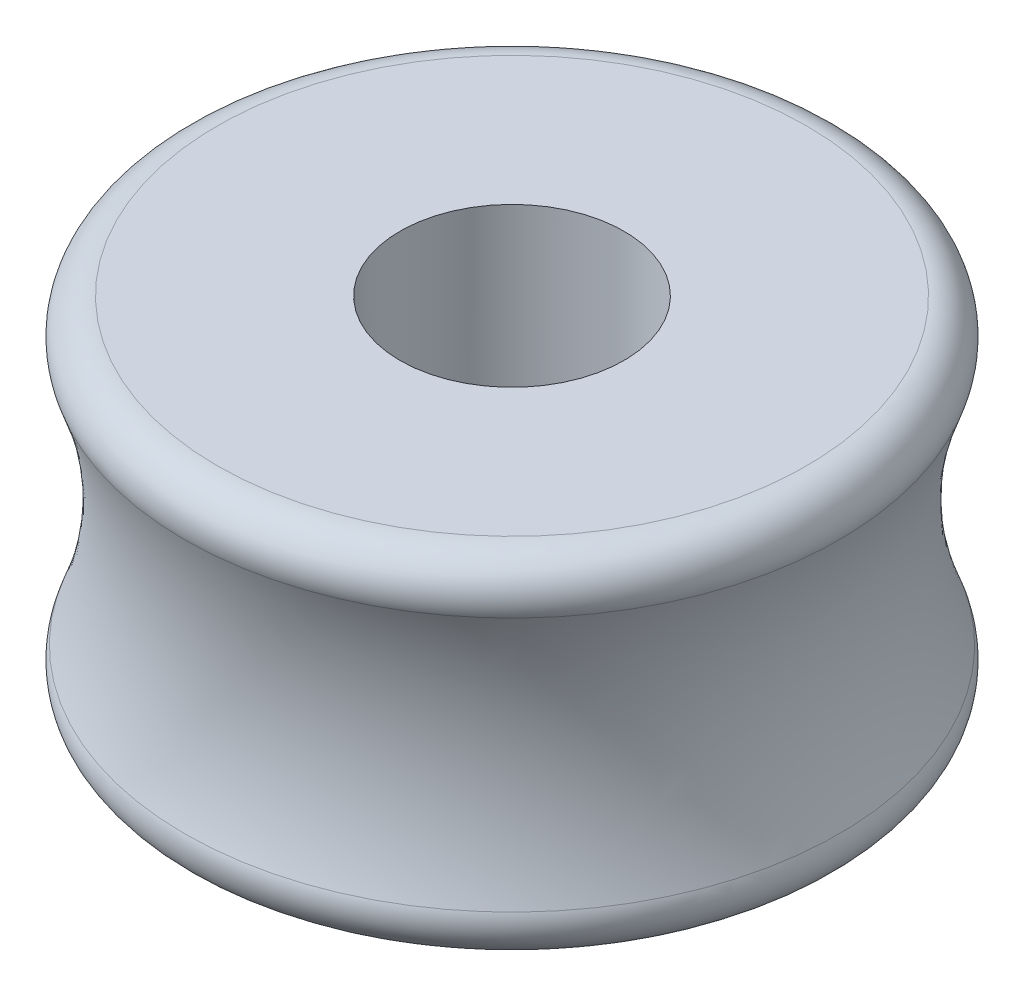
from build123d import *

# Parameters (mm, degrees)
CHAMFER1_SIZE = 0.16


with BuildPart() as part:
    # Sketch1 → Revolve1 (revolve)
    with BuildSketch(Plane.XY, mode=Mode.PRIVATE) as revolve1_sk:
        with BuildLine():
            Line((-4.206651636, 0), (-1.6, 0))
            Line((-1.6, 0), (-1.6, -5))
            Line((-1.6, -5), (-4.206651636, -5))
            ThreePointArc((-4.206651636, -5), (-4.619513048, -4.782038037), (-4.672422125, -4.318181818))
            ThreePointArc((-4.672422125, -4.318181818), (-4.330127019, -2.5), (-4.672422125, -0.681818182))
            ThreePointArc((-4.672422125, -0.681818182), (-4.619513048, -0.217961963), (-4.206651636, 0))
        make_face()
    revolve(revolve1_sk.sketch.rotate(Axis((0, 0, 0), (0, -1, 0)), 270), axis=Axis((0, 0, 0), (0, -1, 0)))

    # Chamfer1
    chamfer1_edges = [part.edges().sort_by_distance(p)[0] for p in [
        (0, -5, -1.6),
    ]]
    chamfer(chamfer1_edges, length=CHAMFER1_SIZE)


solid = part.part
